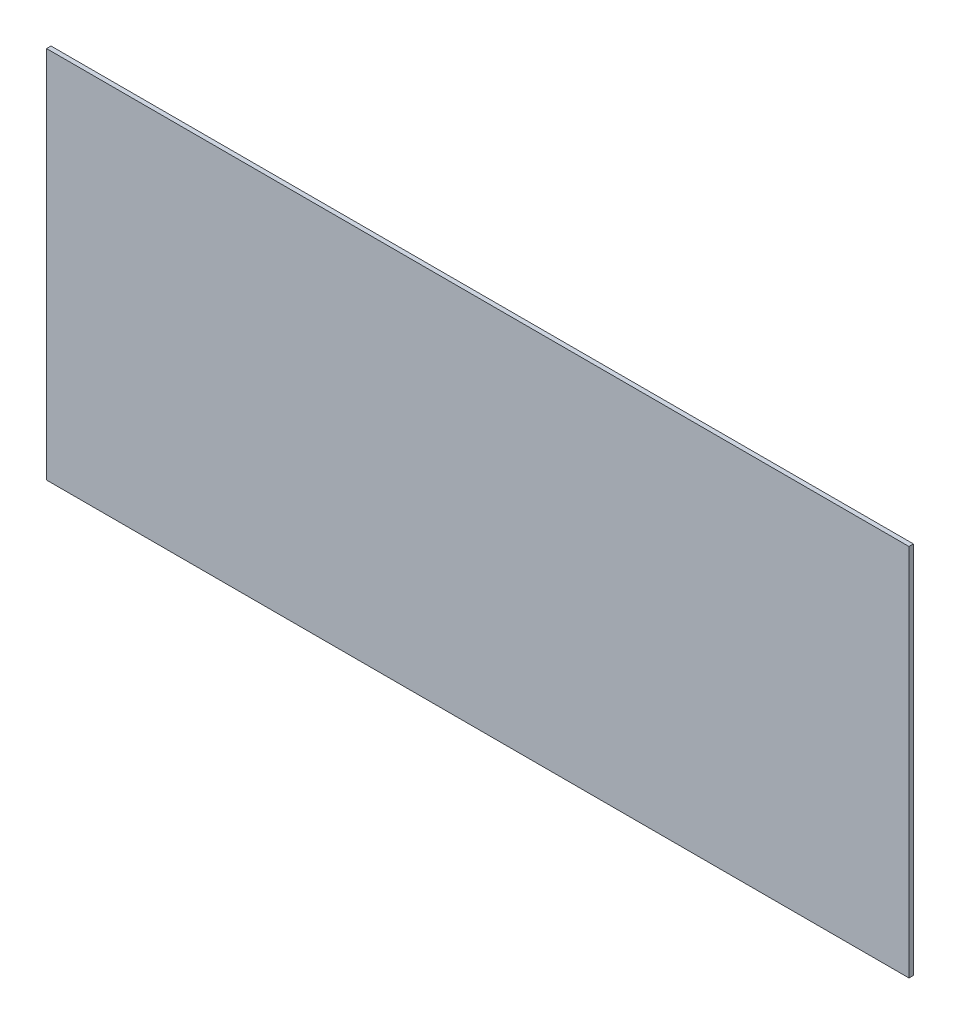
ISO-10303-21;
HEADER;
FILE_DESCRIPTION(('STEP AP214'),'2;1');
FILE_NAME('part.step','',(''),(''),'','','');
FILE_SCHEMA(('AUTOMOTIVE_DESIGN { 1 0 10303 214 1 1 1 1 }'));
ENDSEC;
DATA;
#1=APPLICATION_CONTEXT('core data for automotive mechanical design processes');
#2=APPLICATION_PROTOCOL_DEFINITION('international standard','automotive_design',2000,#1);
#3=PRODUCT_CONTEXT('',#1,'mechanical');
#4=PRODUCT('Part','Part','',(#3));
#5=PRODUCT_RELATED_PRODUCT_CATEGORY('part','',(#4));
#6=PRODUCT_DEFINITION_FORMATION('','',#4);
#7=PRODUCT_DEFINITION_CONTEXT('part definition',#1,'design');
#8=PRODUCT_DEFINITION('design','',#6,#7);
#9=PRODUCT_DEFINITION_SHAPE('','',#8);
#10=(LENGTH_UNIT() NAMED_UNIT(*) SI_UNIT(.MILLI.,.METRE.));
#11=(NAMED_UNIT(*) PLANE_ANGLE_UNIT() SI_UNIT($,.RADIAN.));
#12=(NAMED_UNIT(*) SI_UNIT($,.STERADIAN.) SOLID_ANGLE_UNIT());
#13=UNCERTAINTY_MEASURE_WITH_UNIT(LENGTH_MEASURE(1.E-05),#10,'distance_accuracy_value','');
#14=(GEOMETRIC_REPRESENTATION_CONTEXT(3) GLOBAL_UNCERTAINTY_ASSIGNED_CONTEXT((#13)) GLOBAL_UNIT_ASSIGNED_CONTEXT((#10,
#11,#12)) REPRESENTATION_CONTEXT('',''));
#15=CARTESIAN_POINT('',(0.,0.,0.));
#16=DIRECTION('',(0.,0.,1.));
#17=DIRECTION('',(1.,0.,0.));
#18=AXIS2_PLACEMENT_3D('',#15,#16,#17);
#19=CARTESIAN_POINT('',(457.2,-99.06,76.2));
#20=DIRECTION('',(0.,1.,0.));
#21=DIRECTION('',(0.,0.,1.));
#22=AXIS2_PLACEMENT_3D('',#19,#20,#21);
#23=PLANE('',#22);
#24=DIRECTION('',(0.,0.,-1.));
#25=VECTOR('',#24,1.);
#26=CARTESIAN_POINT('',(0.,-99.06,76.2));
#27=LINE('',#26,#25);
#28=CARTESIAN_POINT('',(0.,-99.06,78.5622));
#29=VERTEX_POINT('',#28);
#30=CARTESIAN_POINT('',(0.,-99.06,76.2));
#31=VERTEX_POINT('',#30);
#32=EDGE_CURVE('E115',#29,#31,#27,.T.);
#33=ORIENTED_EDGE('',*,*,#32,.T.);
#34=DIRECTION('',(-1.,0.,0.));
#35=VECTOR('',#34,1.);
#36=CARTESIAN_POINT('',(457.2,-99.06,76.2));
#37=LINE('',#36,#35);
#38=CARTESIAN_POINT('',(457.2,-99.06,76.2));
#39=VERTEX_POINT('',#38);
#40=EDGE_CURVE('E11',#39,#31,#37,.T.);
#41=ORIENTED_EDGE('',*,*,#40,.F.);
#42=DIRECTION('',(0.,0.,-1.));
#43=VECTOR('',#42,1.);
#44=CARTESIAN_POINT('',(457.2,-99.06,76.2));
#45=LINE('',#44,#43);
#46=CARTESIAN_POINT('',(457.2,-99.06,78.5622));
#47=VERTEX_POINT('',#46);
#48=EDGE_CURVE('E92',#47,#39,#45,.T.);
#49=ORIENTED_EDGE('',*,*,#48,.F.);
#50=DIRECTION('',(-1.,0.,0.));
#51=VECTOR('',#50,1.);
#52=CARTESIAN_POINT('',(457.2,-99.06,78.5622));
#53=LINE('',#52,#51);
#54=EDGE_CURVE('E107',#47,#29,#53,.T.);
#55=ORIENTED_EDGE('',*,*,#54,.T.);
#56=EDGE_LOOP('',(#33,#41,#49,#55));
#57=FACE_BOUND('',#56,.T.);
#58=ADVANCED_FACE('F43',(#57),#23,.F.);
#59=CARTESIAN_POINT('',(457.2,-99.06,76.2));
#60=DIRECTION('',(0.,0.,1.));
#61=DIRECTION('',(1.,0.,0.));
#62=AXIS2_PLACEMENT_3D('',#59,#60,#61);
#63=PLANE('',#62);
#64=DIRECTION('',(0.,1.,0.));
#65=VECTOR('',#64,1.);
#66=CARTESIAN_POINT('',(0.,-99.06,76.2));
#67=LINE('',#66,#65);
#68=CARTESIAN_POINT('',(0.,99.06,76.2));
#69=VERTEX_POINT('',#68);
#70=EDGE_CURVE('E99',#31,#69,#67,.T.);
#71=ORIENTED_EDGE('',*,*,#70,.T.);
#72=DIRECTION('',(-1.,0.,0.));
#73=VECTOR('',#72,1.);
#74=CARTESIAN_POINT('',(457.2,99.06,76.2));
#75=LINE('',#74,#73);
#76=CARTESIAN_POINT('',(457.2,99.06,76.2));
#77=VERTEX_POINT('',#76);
#78=EDGE_CURVE('E55',#77,#69,#75,.T.);
#79=ORIENTED_EDGE('',*,*,#78,.F.);
#80=DIRECTION('',(0.,1.,0.));
#81=VECTOR('',#80,1.);
#82=CARTESIAN_POINT('',(457.2,-99.06,76.2));
#83=LINE('',#82,#81);
#84=EDGE_CURVE('E89',#39,#77,#83,.T.);
#85=ORIENTED_EDGE('',*,*,#84,.F.);
#86=ORIENTED_EDGE('',*,*,#40,.T.);
#87=EDGE_LOOP('',(#71,#79,#85,#86));
#88=FACE_BOUND('',#87,.T.);
#89=ADVANCED_FACE('F97',(#88),#63,.F.);
#90=CARTESIAN_POINT('',(457.2,99.06,76.2));
#91=DIRECTION('',(0.,-1.,0.));
#92=DIRECTION('',(0.,0.,-1.));
#93=AXIS2_PLACEMENT_3D('',#90,#91,#92);
#94=PLANE('',#93);
#95=DIRECTION('',(0.,0.,1.));
#96=VECTOR('',#95,1.);
#97=CARTESIAN_POINT('',(0.,99.06,76.2));
#98=LINE('',#97,#96);
#99=CARTESIAN_POINT('',(0.,99.06,78.5622));
#100=VERTEX_POINT('',#99);
#101=EDGE_CURVE('E80',#69,#100,#98,.T.);
#102=ORIENTED_EDGE('',*,*,#101,.T.);
#103=DIRECTION('',(-1.,0.,0.));
#104=VECTOR('',#103,1.);
#105=CARTESIAN_POINT('',(457.2,99.06,78.5622));
#106=LINE('',#105,#104);
#107=CARTESIAN_POINT('',(457.2,99.06,78.5622));
#108=VERTEX_POINT('',#107);
#109=EDGE_CURVE('E105',#108,#100,#106,.T.);
#110=ORIENTED_EDGE('',*,*,#109,.F.);
#111=DIRECTION('',(0.,0.,1.));
#112=VECTOR('',#111,1.);
#113=CARTESIAN_POINT('',(457.2,99.06,76.2));
#114=LINE('',#113,#112);
#115=EDGE_CURVE('E91',#77,#108,#114,.T.);
#116=ORIENTED_EDGE('',*,*,#115,.F.);
#117=ORIENTED_EDGE('',*,*,#78,.T.);
#118=EDGE_LOOP('',(#102,#110,#116,#117));
#119=FACE_BOUND('',#118,.T.);
#120=ADVANCED_FACE('F103',(#119),#94,.F.);
#121=CARTESIAN_POINT('',(457.2,-99.06,78.5622));
#122=DIRECTION('',(0.,0.,-1.));
#123=DIRECTION('',(-1.,0.,0.));
#124=AXIS2_PLACEMENT_3D('',#121,#122,#123);
#125=PLANE('',#124);
#126=DIRECTION('',(0.,-1.,0.));
#127=VECTOR('',#126,1.);
#128=CARTESIAN_POINT('',(0.,-99.06,78.5622));
#129=LINE('',#128,#127);
#130=EDGE_CURVE('E83',#100,#29,#129,.T.);
#131=ORIENTED_EDGE('',*,*,#130,.T.);
#132=ORIENTED_EDGE('',*,*,#54,.F.);
#133=DIRECTION('',(0.,-1.,0.));
#134=VECTOR('',#133,1.);
#135=CARTESIAN_POINT('',(457.2,-99.06,78.5622));
#136=LINE('',#135,#134);
#137=EDGE_CURVE('E58',#108,#47,#136,.T.);
#138=ORIENTED_EDGE('',*,*,#137,.F.);
#139=ORIENTED_EDGE('',*,*,#109,.T.);
#140=EDGE_LOOP('',(#131,#132,#138,#139));
#141=FACE_BOUND('',#140,.T.);
#142=ADVANCED_FACE('F127',(#141),#125,.F.);
#143=CARTESIAN_POINT('',(457.2,0.,0.));
#144=DIRECTION('',(-1.,0.,0.));
#145=DIRECTION('',(0.,0.,1.));
#146=AXIS2_PLACEMENT_3D('',#143,#144,#145);
#147=PLANE('',#146);
#148=ORIENTED_EDGE('',*,*,#48,.T.);
#149=ORIENTED_EDGE('',*,*,#84,.T.);
#150=ORIENTED_EDGE('',*,*,#115,.T.);
#151=ORIENTED_EDGE('',*,*,#137,.T.);
#152=EDGE_LOOP('',(#148,#149,#150,#151));
#153=FACE_BOUND('',#152,.T.);
#154=ADVANCED_FACE('F93',(#153),#147,.F.);
#155=CARTESIAN_POINT('',(0.,0.,0.));
#156=DIRECTION('',(-1.,0.,0.));
#157=DIRECTION('',(0.,0.,1.));
#158=AXIS2_PLACEMENT_3D('',#155,#156,#157);
#159=PLANE('',#158);
#160=ORIENTED_EDGE('',*,*,#32,.F.);
#161=ORIENTED_EDGE('',*,*,#130,.F.);
#162=ORIENTED_EDGE('',*,*,#101,.F.);
#163=ORIENTED_EDGE('',*,*,#70,.F.);
#164=EDGE_LOOP('',(#160,#161,#162,#163));
#165=FACE_BOUND('',#164,.T.);
#166=ADVANCED_FACE('F129',(#165),#159,.T.);
#167=CLOSED_SHELL('',(#58,#89,#120,#142,#154,#166));
#168=MANIFOLD_SOLID_BREP('B2',#167);
#169=ADVANCED_BREP_SHAPE_REPRESENTATION('',(#18,#168),#14);
#170=SHAPE_DEFINITION_REPRESENTATION(#9,#169);
ENDSEC;
END-ISO-10303-21;
